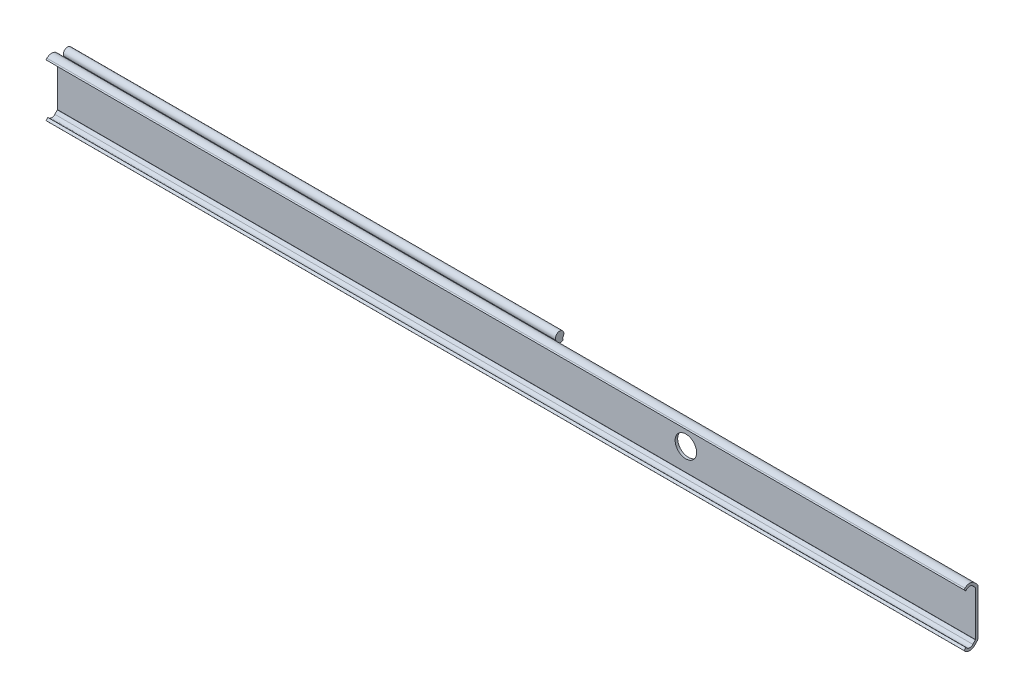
ISO-10303-21;
HEADER;
FILE_DESCRIPTION(('STEP AP214'),'2;1');
FILE_NAME('part.step','',(''),(''),'','','');
FILE_SCHEMA(('AUTOMOTIVE_DESIGN { 1 0 10303 214 1 1 1 1 }'));
ENDSEC;
DATA;
#1=APPLICATION_CONTEXT('core data for automotive mechanical design processes');
#2=APPLICATION_PROTOCOL_DEFINITION('international standard','automotive_design',2000,#1);
#3=PRODUCT_CONTEXT('',#1,'mechanical');
#4=PRODUCT('Part','Part','',(#3));
#5=PRODUCT_RELATED_PRODUCT_CATEGORY('part','',(#4));
#6=PRODUCT_DEFINITION_FORMATION('','',#4);
#7=PRODUCT_DEFINITION_CONTEXT('part definition',#1,'design');
#8=PRODUCT_DEFINITION('design','',#6,#7);
#9=PRODUCT_DEFINITION_SHAPE('','',#8);
#10=(LENGTH_UNIT() NAMED_UNIT(*) SI_UNIT(.MILLI.,.METRE.));
#11=(NAMED_UNIT(*) PLANE_ANGLE_UNIT() SI_UNIT($,.RADIAN.));
#12=(NAMED_UNIT(*) SI_UNIT($,.STERADIAN.) SOLID_ANGLE_UNIT());
#13=UNCERTAINTY_MEASURE_WITH_UNIT(LENGTH_MEASURE(1.E-05),#10,'distance_accuracy_value','');
#14=(GEOMETRIC_REPRESENTATION_CONTEXT(3) GLOBAL_UNCERTAINTY_ASSIGNED_CONTEXT((#13)) GLOBAL_UNIT_ASSIGNED_CONTEXT((#10,
#11,#12)) REPRESENTATION_CONTEXT('',''));
#15=CARTESIAN_POINT('',(0.,0.,0.));
#16=DIRECTION('',(0.,0.,1.));
#17=DIRECTION('',(1.,0.,0.));
#18=AXIS2_PLACEMENT_3D('',#15,#16,#17);
#19=CARTESIAN_POINT('',(0.,-13.5610180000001,0.));
#20=DIRECTION('',(0.,0.,-1.));
#21=DIRECTION('',(1.,0.,0.));
#22=AXIS2_PLACEMENT_3D('',#19,#20,#21);
#23=PLANE('',#22);
#24=CARTESIAN_POINT('',(379.8,0.,0.));
#25=DIRECTION('',(0.,0.,-1.));
#26=DIRECTION('',(0.,1.,0.));
#27=AXIS2_PLACEMENT_3D('',#24,#25,#26);
#28=CIRCLE('',#27,6.5);
#29=CARTESIAN_POINT('',(379.8,6.5,0.));
#30=VERTEX_POINT('',#29);
#31=EDGE_CURVE('E326',#30,#30,#28,.T.);
#32=ORIENTED_EDGE('',*,*,#31,.F.);
#33=EDGE_LOOP('',(#32));
#34=FACE_BOUND('',#33,.T.);
#35=DIRECTION('',(0.,1.,0.));
#36=VECTOR('',#35,1.);
#37=CARTESIAN_POINT('',(0.,-13.5610180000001,0.));
#38=LINE('',#37,#36);
#39=CARTESIAN_POINT('',(0.,-13.5610180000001,0.));
#40=VERTEX_POINT('',#39);
#41=CARTESIAN_POINT('',(0.,-10.7622239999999,0.));
#42=VERTEX_POINT('',#41);
#43=EDGE_CURVE('E443',#40,#42,#38,.T.);
#44=ORIENTED_EDGE('',*,*,#43,.T.);
#45=DIRECTION('',(1.,0.,0.));
#46=VECTOR('',#45,1.);
#47=CARTESIAN_POINT('',(0.,-10.7622239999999,0.));
#48=LINE('',#47,#46);
#49=CARTESIAN_POINT('',(297.4,-10.7622239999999,0.));
#50=VERTEX_POINT('',#49);
#51=EDGE_CURVE('E9',#42,#50,#48,.T.);
#52=ORIENTED_EDGE('',*,*,#51,.T.);
#53=DIRECTION('',(0.,-1.,0.));
#54=VECTOR('',#53,1.);
#55=CARTESIAN_POINT('',(297.4,10.7622239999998,0.));
#56=LINE('',#55,#54);
#57=CARTESIAN_POINT('',(297.4,10.7622239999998,0.));
#58=VERTEX_POINT('',#57);
#59=EDGE_CURVE('E323',#58,#50,#56,.T.);
#60=ORIENTED_EDGE('',*,*,#59,.F.);
#61=DIRECTION('',(1.,0.,0.));
#62=VECTOR('',#61,1.);
#63=CARTESIAN_POINT('',(0.,10.7622239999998,0.));
#64=LINE('',#63,#62);
#65=CARTESIAN_POINT('',(0.,10.7622239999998,0.));
#66=VERTEX_POINT('',#65);
#67=EDGE_CURVE('E23',#66,#58,#64,.T.);
#68=ORIENTED_EDGE('',*,*,#67,.F.);
#69=CARTESIAN_POINT('',(0.,13.561018,0.));
#70=VERTEX_POINT('',#69);
#71=EDGE_CURVE('E442',#66,#70,#38,.T.);
#72=ORIENTED_EDGE('',*,*,#71,.T.);
#73=DIRECTION('',(1.,0.,0.));
#74=VECTOR('',#73,1.);
#75=CARTESIAN_POINT('',(0.,13.561018,0.));
#76=LINE('',#75,#74);
#77=CARTESIAN_POINT('',(554.8,13.561018,0.));
#78=VERTEX_POINT('',#77);
#79=EDGE_CURVE('E456',#70,#78,#76,.T.);
#80=ORIENTED_EDGE('',*,*,#79,.T.);
#81=DIRECTION('',(0.,1.,0.));
#82=VECTOR('',#81,1.);
#83=CARTESIAN_POINT('',(554.8,-13.5610180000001,0.));
#84=LINE('',#83,#82);
#85=CARTESIAN_POINT('',(554.8,-13.5610180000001,0.));
#86=VERTEX_POINT('',#85);
#87=EDGE_CURVE('E383',#86,#78,#84,.T.);
#88=ORIENTED_EDGE('',*,*,#87,.F.);
#89=DIRECTION('',(1.,0.,0.));
#90=VECTOR('',#89,1.);
#91=CARTESIAN_POINT('',(0.,-13.5610180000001,0.));
#92=LINE('',#91,#90);
#93=EDGE_CURVE('E459',#40,#86,#92,.T.);
#94=ORIENTED_EDGE('',*,*,#93,.F.);
#95=EDGE_LOOP('',(#44,#52,#60,#68,#72,#80,#88,#94));
#96=FACE_BOUND('',#95,.T.);
#97=ADVANCED_FACE('F14',(#34,#96),#23,.T.);
#98=CARTESIAN_POINT('',(0.,-10.7622239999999,-1.66));
#99=DIRECTION('',(1.,0.,0.));
#100=DIRECTION('',(0.,0.,1.));
#101=AXIS2_PLACEMENT_3D('',#98,#99,#100);
#102=CYLINDRICAL_SURFACE('',#101,1.66);
#103=DIRECTION('',(1.,0.,0.));
#104=VECTOR('',#103,1.);
#105=CARTESIAN_POINT('',(0.,-12.2669175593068,-2.36106867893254));
#106=LINE('',#105,#104);
#107=CARTESIAN_POINT('',(0.,-12.2669175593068,-2.36106867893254));
#108=VERTEX_POINT('',#107);
#109=CARTESIAN_POINT('',(297.4,-12.2669175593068,-2.36106867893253));
#110=VERTEX_POINT('',#109);
#111=EDGE_CURVE('E237',#108,#110,#106,.T.);
#112=ORIENTED_EDGE('',*,*,#111,.T.);
#113=CARTESIAN_POINT('',(297.4,-10.7622239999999,-1.66));
#114=DIRECTION('',(1.,0.,0.));
#115=DIRECTION('',(0.,0.,-1.));
#116=AXIS2_PLACEMENT_3D('',#113,#114,#115);
#117=CIRCLE('',#116,1.66);
#118=EDGE_CURVE('E297',#50,#110,#117,.T.);
#119=ORIENTED_EDGE('',*,*,#118,.F.);
#120=ORIENTED_EDGE('',*,*,#51,.F.);
#121=CARTESIAN_POINT('',(0.,-10.7622239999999,-1.66));
#122=DIRECTION('',(1.,0.,0.));
#123=DIRECTION('',(0.,0.,-1.));
#124=AXIS2_PLACEMENT_3D('',#121,#122,#123);
#125=CIRCLE('',#124,1.66);
#126=EDGE_CURVE('E253',#42,#108,#125,.T.);
#127=ORIENTED_EDGE('',*,*,#126,.T.);
#128=EDGE_LOOP('',(#112,#119,#120,#127));
#129=FACE_BOUND('',#128,.T.);
#130=ADVANCED_FACE('F258',(#129),#102,.T.);
#131=CARTESIAN_POINT('',(0.,10.7622239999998,-1.66));
#132=DIRECTION('',(1.,0.,0.));
#133=DIRECTION('',(0.,0.,1.));
#134=AXIS2_PLACEMENT_3D('',#131,#132,#133);
#135=CYLINDRICAL_SURFACE('',#134,1.66);
#136=CARTESIAN_POINT('',(297.4,10.7622239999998,-1.66));
#137=DIRECTION('',(1.,0.,0.));
#138=DIRECTION('',(0.,0.,-1.));
#139=AXIS2_PLACEMENT_3D('',#136,#137,#138);
#140=CIRCLE('',#139,1.65999999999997);
#141=CARTESIAN_POINT('',(297.4,12.2669175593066,-2.36106867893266));
#142=VERTEX_POINT('',#141);
#143=EDGE_CURVE('E321',#142,#58,#140,.T.);
#144=ORIENTED_EDGE('',*,*,#143,.F.);
#145=DIRECTION('',(1.,0.,0.));
#146=VECTOR('',#145,1.);
#147=CARTESIAN_POINT('',(0.,12.2669175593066,-2.36106867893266));
#148=LINE('',#147,#146);
#149=CARTESIAN_POINT('',(0.,12.2669175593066,-2.36106867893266));
#150=VERTEX_POINT('',#149);
#151=EDGE_CURVE('E295',#150,#142,#148,.T.);
#152=ORIENTED_EDGE('',*,*,#151,.F.);
#153=CARTESIAN_POINT('',(0.,10.7622239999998,-1.66));
#154=DIRECTION('',(1.,0.,0.));
#155=DIRECTION('',(0.,0.,-1.));
#156=AXIS2_PLACEMENT_3D('',#153,#154,#155);
#157=CIRCLE('',#156,1.65999999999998);
#158=EDGE_CURVE('E245',#150,#66,#157,.T.);
#159=ORIENTED_EDGE('',*,*,#158,.T.);
#160=ORIENTED_EDGE('',*,*,#67,.T.);
#161=EDGE_LOOP('',(#144,#152,#159,#160));
#162=FACE_BOUND('',#161,.T.);
#163=ADVANCED_FACE('F554',(#162),#135,.T.);
#164=CARTESIAN_POINT('',(0.,11.8784795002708,-5.98462837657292));
#165=DIRECTION('',(0.,0.60181512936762,-0.798635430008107));
#166=DIRECTION('',(0.,0.798635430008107,0.60181512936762));
#167=AXIS2_PLACEMENT_3D('',#164,#165,#166);
#168=PLANE('',#167);
#169=DIRECTION('',(1.,0.,0.));
#170=VECTOR('',#169,1.);
#171=CARTESIAN_POINT('',(0.,11.6159967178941,-6.18242339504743));
#172=LINE('',#171,#170);
#173=CARTESIAN_POINT('',(0.,11.6159967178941,-6.18242339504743));
#174=VERTEX_POINT('',#173);
#175=CARTESIAN_POINT('',(297.4,11.6159967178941,-6.18242339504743));
#176=VERTEX_POINT('',#175);
#177=EDGE_CURVE('E298',#174,#176,#172,.T.);
#178=ORIENTED_EDGE('',*,*,#177,.T.);
#179=DIRECTION('',(0.,0.798635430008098,0.601815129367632));
#180=VECTOR('',#179,1.);
#181=CARTESIAN_POINT('',(297.4,11.0618539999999,-6.6));
#182=LINE('',#181,#180);
#183=CARTESIAN_POINT('',(297.4,11.0618539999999,-6.6));
#184=VERTEX_POINT('',#183);
#185=EDGE_CURVE('E318',#184,#176,#182,.T.);
#186=ORIENTED_EDGE('',*,*,#185,.F.);
#187=DIRECTION('',(1.,0.,0.));
#188=VECTOR('',#187,1.);
#189=CARTESIAN_POINT('',(0.,11.0618539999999,-6.6));
#190=LINE('',#189,#188);
#191=CARTESIAN_POINT('',(0.,11.0618539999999,-6.6));
#192=VERTEX_POINT('',#191);
#193=EDGE_CURVE('E335',#192,#184,#190,.T.);
#194=ORIENTED_EDGE('',*,*,#193,.F.);
#195=DIRECTION('',(0.,0.798635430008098,0.601815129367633));
#196=VECTOR('',#195,1.);
#197=CARTESIAN_POINT('',(0.,11.0618539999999,-6.6));
#198=LINE('',#197,#196);
#199=EDGE_CURVE('E286',#192,#174,#198,.T.);
#200=ORIENTED_EDGE('',*,*,#199,.T.);
#201=EDGE_LOOP('',(#178,#186,#194,#200));
#202=FACE_BOUND('',#201,.T.);
#203=ADVANCED_FACE('F547',(#202),#168,.T.);
#204=CARTESIAN_POINT('',(0.,11.0618539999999,-6.6));
#205=DIRECTION('',(0.,0.,-1.));
#206=DIRECTION('',(1.,0.,0.));
#207=AXIS2_PLACEMENT_3D('',#204,#205,#206);
#208=PLANE('',#207);
#209=ORIENTED_EDGE('',*,*,#193,.T.);
#210=DIRECTION('',(0.,1.,0.));
#211=VECTOR('',#210,1.);
#212=CARTESIAN_POINT('',(297.4,10.4239399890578,-6.6));
#213=LINE('',#212,#211);
#214=CARTESIAN_POINT('',(297.4,10.4239399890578,-6.6));
#215=VERTEX_POINT('',#214);
#216=EDGE_CURVE('E316',#215,#184,#213,.T.);
#217=ORIENTED_EDGE('',*,*,#216,.F.);
#218=DIRECTION('',(1.,0.,0.));
#219=VECTOR('',#218,1.);
#220=CARTESIAN_POINT('',(0.,10.4239399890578,-6.6));
#221=LINE('',#220,#219);
#222=CARTESIAN_POINT('',(0.,10.4239399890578,-6.6));
#223=VERTEX_POINT('',#222);
#224=EDGE_CURVE('E495',#223,#215,#221,.T.);
#225=ORIENTED_EDGE('',*,*,#224,.F.);
#226=DIRECTION('',(0.,1.,0.));
#227=VECTOR('',#226,1.);
#228=CARTESIAN_POINT('',(0.,10.4239399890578,-6.6));
#229=LINE('',#228,#227);
#230=EDGE_CURVE('E283',#223,#192,#229,.T.);
#231=ORIENTED_EDGE('',*,*,#230,.T.);
#232=EDGE_LOOP('',(#209,#217,#225,#231));
#233=FACE_BOUND('',#232,.T.);
#234=ADVANCED_FACE('F542',(#233),#208,.T.);
#235=CARTESIAN_POINT('',(0.,13.915,-4.44999999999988));
#236=DIRECTION('',(1.,0.,0.));
#237=DIRECTION('',(0.,0.,1.));
#238=AXIS2_PLACEMENT_3D('',#235,#236,#237);
#239=CYLINDRICAL_SURFACE('',#238,4.1);
#240=ORIENTED_EDGE('',*,*,#224,.T.);
#241=CARTESIAN_POINT('',(297.4,13.915,-4.44999999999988));
#242=DIRECTION('',(1.,0.,0.));
#243=DIRECTION('',(0.,0.,-1.));
#244=AXIS2_PLACEMENT_3D('',#241,#242,#243);
#245=CIRCLE('',#244,4.1);
#246=CARTESIAN_POINT('',(297.4,10.844402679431,-1.73312089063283));
#247=VERTEX_POINT('',#246);
#248=EDGE_CURVE('E314',#247,#215,#245,.T.);
#249=ORIENTED_EDGE('',*,*,#248,.F.);
#250=DIRECTION('',(1.,0.,0.));
#251=VECTOR('',#250,1.);
#252=CARTESIAN_POINT('',(0.,10.8444026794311,-1.73312089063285));
#253=LINE('',#252,#251);
#254=CARTESIAN_POINT('',(0.,10.844402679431,-1.73312089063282));
#255=VERTEX_POINT('',#254);
#256=EDGE_CURVE('E498',#255,#247,#253,.T.);
#257=ORIENTED_EDGE('',*,*,#256,.F.);
#258=CARTESIAN_POINT('',(0.,13.915,-4.44999999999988));
#259=DIRECTION('',(1.,0.,0.));
#260=DIRECTION('',(0.,0.,-1.));
#261=AXIS2_PLACEMENT_3D('',#258,#259,#260);
#262=CIRCLE('',#261,4.1);
#263=EDGE_CURVE('E280',#255,#223,#262,.T.);
#264=ORIENTED_EDGE('',*,*,#263,.T.);
#265=EDGE_LOOP('',(#240,#249,#257,#264));
#266=FACE_BOUND('',#265,.T.);
#267=ADVANCED_FACE('F540',(#266),#239,.T.);
#268=CARTESIAN_POINT('',(0.,10.7622239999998,-1.66));
#269=DIRECTION('',(1.,0.,0.));
#270=DIRECTION('',(0.,0.,1.));
#271=AXIS2_PLACEMENT_3D('',#268,#269,#270);
#272=CYLINDRICAL_SURFACE('',#271,0.110000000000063);
#273=ORIENTED_EDGE('',*,*,#256,.T.);
#274=CARTESIAN_POINT('',(297.4,10.7622239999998,-1.66));
#275=DIRECTION('',(-1.,0.,0.));
#276=DIRECTION('',(0.,0.,-1.));
#277=AXIS2_PLACEMENT_3D('',#274,#275,#276);
#278=CIRCLE('',#277,0.110000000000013);
#279=CARTESIAN_POINT('',(297.4,10.7622239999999,-1.55));
#280=VERTEX_POINT('',#279);
#281=EDGE_CURVE('E312',#280,#247,#278,.T.);
#282=ORIENTED_EDGE('',*,*,#281,.F.);
#283=DIRECTION('',(1.,0.,0.));
#284=VECTOR('',#283,1.);
#285=CARTESIAN_POINT('',(0.,10.7622239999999,-1.55));
#286=LINE('',#285,#284);
#287=CARTESIAN_POINT('',(0.,10.7622239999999,-1.55));
#288=VERTEX_POINT('',#287);
#289=EDGE_CURVE('E501',#288,#280,#286,.T.);
#290=ORIENTED_EDGE('',*,*,#289,.F.);
#291=CARTESIAN_POINT('',(0.,10.7622239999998,-1.66));
#292=DIRECTION('',(-1.,0.,0.));
#293=DIRECTION('',(0.,0.,-1.));
#294=AXIS2_PLACEMENT_3D('',#291,#292,#293);
#295=CIRCLE('',#294,0.110000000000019);
#296=EDGE_CURVE('E277',#288,#255,#295,.T.);
#297=ORIENTED_EDGE('',*,*,#296,.T.);
#298=EDGE_LOOP('',(#273,#282,#290,#297));
#299=FACE_BOUND('',#298,.T.);
#300=ADVANCED_FACE('F535',(#299),#272,.F.);
#301=CARTESIAN_POINT('',(0.,-10.762224,-1.55));
#302=DIRECTION('',(0.,0.,-1.));
#303=DIRECTION('',(1.,0.,0.));
#304=AXIS2_PLACEMENT_3D('',#301,#302,#303);
#305=PLANE('',#304);
#306=ORIENTED_EDGE('',*,*,#289,.T.);
#307=DIRECTION('',(0.,1.,0.));
#308=VECTOR('',#307,1.);
#309=CARTESIAN_POINT('',(297.4,-10.762224,-1.55));
#310=LINE('',#309,#308);
#311=CARTESIAN_POINT('',(297.4,-10.762224,-1.55));
#312=VERTEX_POINT('',#311);
#313=EDGE_CURVE('E310',#312,#280,#310,.T.);
#314=ORIENTED_EDGE('',*,*,#313,.F.);
#315=DIRECTION('',(1.,0.,0.));
#316=VECTOR('',#315,1.);
#317=CARTESIAN_POINT('',(0.,-10.762224,-1.55));
#318=LINE('',#317,#316);
#319=CARTESIAN_POINT('',(0.,-10.762224,-1.55));
#320=VERTEX_POINT('',#319);
#321=EDGE_CURVE('E504',#320,#312,#318,.T.);
#322=ORIENTED_EDGE('',*,*,#321,.F.);
#323=DIRECTION('',(0.,1.,0.));
#324=VECTOR('',#323,1.);
#325=CARTESIAN_POINT('',(0.,-10.762224,-1.55));
#326=LINE('',#325,#324);
#327=EDGE_CURVE('E274',#320,#288,#326,.T.);
#328=ORIENTED_EDGE('',*,*,#327,.T.);
#329=EDGE_LOOP('',(#306,#314,#322,#328));
#330=FACE_BOUND('',#329,.T.);
#331=ADVANCED_FACE('F530',(#330),#305,.T.);
#332=CARTESIAN_POINT('',(0.,-10.7622239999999,-1.66));
#333=DIRECTION('',(1.,0.,0.));
#334=DIRECTION('',(0.,0.,1.));
#335=AXIS2_PLACEMENT_3D('',#332,#333,#334);
#336=CYLINDRICAL_SURFACE('',#335,0.110000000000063);
#337=ORIENTED_EDGE('',*,*,#321,.T.);
#338=CARTESIAN_POINT('',(297.4,-10.7622239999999,-1.66));
#339=DIRECTION('',(-1.,0.,0.));
#340=DIRECTION('',(0.,0.,-1.));
#341=AXIS2_PLACEMENT_3D('',#338,#339,#340);
#342=CIRCLE('',#341,0.110000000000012);
#343=CARTESIAN_POINT('',(297.4,-10.8444026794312,-1.73312089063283));
#344=VERTEX_POINT('',#343);
#345=EDGE_CURVE('E308',#344,#312,#342,.T.);
#346=ORIENTED_EDGE('',*,*,#345,.F.);
#347=DIRECTION('',(1.,0.,0.));
#348=VECTOR('',#347,1.);
#349=CARTESIAN_POINT('',(0.,-10.8444026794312,-1.73312089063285));
#350=LINE('',#349,#348);
#351=CARTESIAN_POINT('',(0.,-10.8444026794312,-1.73312089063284));
#352=VERTEX_POINT('',#351);
#353=EDGE_CURVE('E507',#352,#344,#350,.T.);
#354=ORIENTED_EDGE('',*,*,#353,.F.);
#355=CARTESIAN_POINT('',(0.,-10.7622239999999,-1.66));
#356=DIRECTION('',(-1.,0.,0.));
#357=DIRECTION('',(0.,0.,-1.));
#358=AXIS2_PLACEMENT_3D('',#355,#356,#357);
#359=CIRCLE('',#358,0.110000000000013);
#360=EDGE_CURVE('E271',#352,#320,#359,.T.);
#361=ORIENTED_EDGE('',*,*,#360,.T.);
#362=EDGE_LOOP('',(#337,#346,#354,#361));
#363=FACE_BOUND('',#362,.T.);
#364=ADVANCED_FACE('F528',(#363),#336,.F.);
#365=CARTESIAN_POINT('',(0.,-13.915,-4.44999999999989));
#366=DIRECTION('',(1.,0.,0.));
#367=DIRECTION('',(0.,0.,1.));
#368=AXIS2_PLACEMENT_3D('',#365,#366,#367);
#369=CYLINDRICAL_SURFACE('',#368,4.1);
#370=ORIENTED_EDGE('',*,*,#353,.T.);
#371=CARTESIAN_POINT('',(297.4,-13.915,-4.44999999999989));
#372=DIRECTION('',(1.,0.,0.));
#373=DIRECTION('',(0.,0.,-1.));
#374=AXIS2_PLACEMENT_3D('',#371,#372,#373);
#375=CIRCLE('',#374,4.09999999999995);
#376=CARTESIAN_POINT('',(297.4,-10.4239399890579,-6.6));
#377=VERTEX_POINT('',#376);
#378=EDGE_CURVE('E306',#377,#344,#375,.T.);
#379=ORIENTED_EDGE('',*,*,#378,.F.);
#380=DIRECTION('',(1.,0.,0.));
#381=VECTOR('',#380,1.);
#382=CARTESIAN_POINT('',(0.,-10.4239399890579,-6.6));
#383=LINE('',#382,#381);
#384=CARTESIAN_POINT('',(0.,-10.4239399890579,-6.6));
#385=VERTEX_POINT('',#384);
#386=EDGE_CURVE('E509',#385,#377,#383,.T.);
#387=ORIENTED_EDGE('',*,*,#386,.F.);
#388=CARTESIAN_POINT('',(0.,-13.915,-4.44999999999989));
#389=DIRECTION('',(1.,0.,0.));
#390=DIRECTION('',(0.,0.,-1.));
#391=AXIS2_PLACEMENT_3D('',#388,#389,#390);
#392=CIRCLE('',#391,4.09999999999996);
#393=EDGE_CURVE('E268',#385,#352,#392,.T.);
#394=ORIENTED_EDGE('',*,*,#393,.T.);
#395=EDGE_LOOP('',(#370,#379,#387,#394));
#396=FACE_BOUND('',#395,.T.);
#397=ADVANCED_FACE('F521',(#396),#369,.T.);
#398=CARTESIAN_POINT('',(0.,-11.061854,-6.6));
#399=DIRECTION('',(0.,0.,-1.));
#400=DIRECTION('',(1.,0.,0.));
#401=AXIS2_PLACEMENT_3D('',#398,#399,#400);
#402=PLANE('',#401);
#403=ORIENTED_EDGE('',*,*,#386,.T.);
#404=DIRECTION('',(0.,1.,0.));
#405=VECTOR('',#404,1.);
#406=CARTESIAN_POINT('',(297.4,-11.061854,-6.6));
#407=LINE('',#406,#405);
#408=CARTESIAN_POINT('',(297.4,-11.061854,-6.6));
#409=VERTEX_POINT('',#408);
#410=EDGE_CURVE('E304',#409,#377,#407,.T.);
#411=ORIENTED_EDGE('',*,*,#410,.F.);
#412=DIRECTION('',(1.,0.,0.));
#413=VECTOR('',#412,1.);
#414=CARTESIAN_POINT('',(0.,-11.061854,-6.6));
#415=LINE('',#414,#413);
#416=CARTESIAN_POINT('',(0.,-11.061854,-6.6));
#417=VERTEX_POINT('',#416);
#418=EDGE_CURVE('E18',#417,#409,#415,.T.);
#419=ORIENTED_EDGE('',*,*,#418,.F.);
#420=DIRECTION('',(0.,1.,0.));
#421=VECTOR('',#420,1.);
#422=CARTESIAN_POINT('',(0.,-11.061854,-6.6));
#423=LINE('',#422,#421);
#424=EDGE_CURVE('E265',#417,#385,#423,.T.);
#425=ORIENTED_EDGE('',*,*,#424,.T.);
#426=EDGE_LOOP('',(#403,#411,#419,#425));
#427=FACE_BOUND('',#426,.T.);
#428=ADVANCED_FACE('F516',(#427),#402,.T.);
#429=CARTESIAN_POINT('',(0.,-11.8784795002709,-5.98462837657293));
#430=DIRECTION('',(0.,-0.60181512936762,-0.798635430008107));
#431=DIRECTION('',(0.,0.798635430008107,-0.60181512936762));
#432=AXIS2_PLACEMENT_3D('',#429,#430,#431);
#433=PLANE('',#432);
#434=DIRECTION('',(0.,0.798635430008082,-0.601815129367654));
#435=VECTOR('',#434,1.);
#436=CARTESIAN_POINT('',(297.4,-11.878479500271,-5.98462837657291));
#437=LINE('',#436,#435);
#438=CARTESIAN_POINT('',(297.4,-11.6159967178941,-6.18242339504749));
#439=VERTEX_POINT('',#438);
#440=EDGE_CURVE('E302',#439,#409,#437,.T.);
#441=ORIENTED_EDGE('',*,*,#440,.F.);
#442=DIRECTION('',(1.,0.,0.));
#443=VECTOR('',#442,1.);
#444=CARTESIAN_POINT('',(0.,-11.6159967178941,-6.18242339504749));
#445=LINE('',#444,#443);
#446=CARTESIAN_POINT('',(0.,-11.6159967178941,-6.18242339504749));
#447=VERTEX_POINT('',#446);
#448=EDGE_CURVE('E244',#447,#439,#445,.T.);
#449=ORIENTED_EDGE('',*,*,#448,.F.);
#450=DIRECTION('',(0.,0.798635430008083,-0.601815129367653));
#451=VECTOR('',#450,1.);
#452=CARTESIAN_POINT('',(0.,-11.6159967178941,-6.18242339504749));
#453=LINE('',#452,#451);
#454=EDGE_CURVE('E256',#447,#417,#453,.T.);
#455=ORIENTED_EDGE('',*,*,#454,.T.);
#456=ORIENTED_EDGE('',*,*,#418,.T.);
#457=EDGE_LOOP('',(#441,#449,#455,#456));
#458=FACE_BOUND('',#457,.T.);
#459=ADVANCED_FACE('F16',(#458),#433,.T.);
#460=CARTESIAN_POINT('',(0.,14.8073560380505,0.501292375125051));
#461=DIRECTION('',(0.,0.692409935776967,-0.721504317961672));
#462=DIRECTION('',(0.,0.721504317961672,0.692409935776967));
#463=AXIS2_PLACEMENT_3D('',#460,#461,#462);
#464=PLANE('',#463);
#465=DIRECTION('',(0.,0.721504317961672,0.692409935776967));
#466=VECTOR('',#465,1.);
#467=CARTESIAN_POINT('',(554.8,14.8073560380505,0.501292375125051));
#468=LINE('',#467,#466);
#469=CARTESIAN_POINT('',(554.8,14.8073560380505,0.501292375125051));
#470=VERTEX_POINT('',#469);
#471=CARTESIAN_POINT('',(554.8,16.4741282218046,2.10085261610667));
#472=VERTEX_POINT('',#471);
#473=EDGE_CURVE('E388',#470,#472,#468,.T.);
#474=ORIENTED_EDGE('',*,*,#473,.F.);
#475=DIRECTION('',(1.,0.,0.));
#476=VECTOR('',#475,1.);
#477=CARTESIAN_POINT('',(0.,14.8073560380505,0.501292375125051));
#478=LINE('',#477,#476);
#479=CARTESIAN_POINT('',(0.,14.8073560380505,0.501292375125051));
#480=VERTEX_POINT('',#479);
#481=EDGE_CURVE('E454',#480,#470,#478,.T.);
#482=ORIENTED_EDGE('',*,*,#481,.F.);
#483=DIRECTION('',(0.,0.721504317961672,0.692409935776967));
#484=VECTOR('',#483,1.);
#485=CARTESIAN_POINT('',(0.,14.8073560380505,0.501292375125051));
#486=LINE('',#485,#484);
#487=CARTESIAN_POINT('',(0.,16.4741282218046,2.10085261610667));
#488=VERTEX_POINT('',#487);
#489=EDGE_CURVE('E448',#480,#488,#486,.T.);
#490=ORIENTED_EDGE('',*,*,#489,.T.);
#491=DIRECTION('',(1.,0.,0.));
#492=VECTOR('',#491,1.);
#493=CARTESIAN_POINT('',(0.,16.4741282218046,2.10085261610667));
#494=LINE('',#493,#492);
#495=EDGE_CURVE('E452',#488,#472,#494,.T.);
#496=ORIENTED_EDGE('',*,*,#495,.T.);
#497=EDGE_LOOP('',(#474,#482,#490,#496));
#498=FACE_BOUND('',#497,.T.);
#499=ADVANCED_FACE('F627',(#498),#464,.T.);
#500=CARTESIAN_POINT('',(0.,13.5610179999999,1.8));
#501=DIRECTION('',(1.,0.,0.));
#502=DIRECTION('',(0.,0.,1.));
#503=AXIS2_PLACEMENT_3D('',#500,#501,#502);
#504=CYLINDRICAL_SURFACE('',#503,1.8);
#505=CARTESIAN_POINT('',(554.8,13.5610179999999,1.8));
#506=DIRECTION('',(1.,0.,0.));
#507=DIRECTION('',(0.,0.,-1.));
#508=AXIS2_PLACEMENT_3D('',#505,#506,#507);
#509=CIRCLE('',#508,1.8);
#510=EDGE_CURVE('E385',#78,#470,#509,.T.);
#511=ORIENTED_EDGE('',*,*,#510,.F.);
#512=ORIENTED_EDGE('',*,*,#79,.F.);
#513=CARTESIAN_POINT('',(0.,13.5610179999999,1.8));
#514=DIRECTION('',(1.,0.,0.));
#515=DIRECTION('',(0.,0.,-1.));
#516=AXIS2_PLACEMENT_3D('',#513,#514,#515);
#517=CIRCLE('',#516,1.8);
#518=EDGE_CURVE('E445',#70,#480,#517,.T.);
#519=ORIENTED_EDGE('',*,*,#518,.T.);
#520=ORIENTED_EDGE('',*,*,#481,.T.);
#521=EDGE_LOOP('',(#511,#512,#519,#520));
#522=FACE_BOUND('',#521,.T.);
#523=ADVANCED_FACE('F631',(#522),#504,.T.);
#524=CARTESIAN_POINT('',(0.,-13.561018,1.8));
#525=DIRECTION('',(1.,0.,0.));
#526=DIRECTION('',(0.,0.,1.));
#527=AXIS2_PLACEMENT_3D('',#524,#525,#526);
#528=CYLINDRICAL_SURFACE('',#527,1.8);
#529=CARTESIAN_POINT('',(554.8,-13.561018,1.8));
#530=DIRECTION('',(1.,0.,0.));
#531=DIRECTION('',(0.,0.,1.));
#532=AXIS2_PLACEMENT_3D('',#529,#530,#531);
#533=CIRCLE('',#532,1.8);
#534=CARTESIAN_POINT('',(554.8,-14.8073560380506,0.50129237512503));
#535=VERTEX_POINT('',#534);
#536=EDGE_CURVE('E380',#535,#86,#533,.T.);
#537=ORIENTED_EDGE('',*,*,#536,.F.);
#538=DIRECTION('',(1.,0.,0.));
#539=VECTOR('',#538,1.);
#540=CARTESIAN_POINT('',(0.,-14.8073560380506,0.50129237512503));
#541=LINE('',#540,#539);
#542=CARTESIAN_POINT('',(0.,-14.8073560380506,0.50129237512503));
#543=VERTEX_POINT('',#542);
#544=EDGE_CURVE('E461',#543,#535,#541,.T.);
#545=ORIENTED_EDGE('',*,*,#544,.F.);
#546=CARTESIAN_POINT('',(0.,-13.561018,1.8));
#547=DIRECTION('',(1.,0.,0.));
#548=DIRECTION('',(0.,0.,1.));
#549=AXIS2_PLACEMENT_3D('',#546,#547,#548);
#550=CIRCLE('',#549,1.8);
#551=EDGE_CURVE('E439',#543,#40,#550,.T.);
#552=ORIENTED_EDGE('',*,*,#551,.T.);
#553=ORIENTED_EDGE('',*,*,#93,.T.);
#554=EDGE_LOOP('',(#537,#545,#552,#553));
#555=FACE_BOUND('',#554,.T.);
#556=ADVANCED_FACE('F560',(#555),#528,.T.);
#557=CARTESIAN_POINT('',(0.,-14.8073560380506,0.50129237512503));
#558=DIRECTION('',(0.,-0.692409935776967,-0.721504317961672));
#559=DIRECTION('',(0.,0.721504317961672,-0.692409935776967));
#560=AXIS2_PLACEMENT_3D('',#557,#558,#559);
#561=PLANE('',#560);
#562=DIRECTION('',(0.,0.721504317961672,-0.692409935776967));
#563=VECTOR('',#562,1.);
#564=CARTESIAN_POINT('',(554.8,-14.8073560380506,0.50129237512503));
#565=LINE('',#564,#563);
#566=CARTESIAN_POINT('',(554.8,-16.4741282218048,2.10085261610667));
#567=VERTEX_POINT('',#566);
#568=EDGE_CURVE('E377',#567,#535,#565,.T.);
#569=ORIENTED_EDGE('',*,*,#568,.F.);
#570=DIRECTION('',(1.,0.,0.));
#571=VECTOR('',#570,1.);
#572=CARTESIAN_POINT('',(0.,-16.4741282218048,2.10085261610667));
#573=LINE('',#572,#571);
#574=CARTESIAN_POINT('',(0.,-16.4741282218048,2.10085261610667));
#575=VERTEX_POINT('',#574);
#576=EDGE_CURVE('E463',#575,#567,#573,.T.);
#577=ORIENTED_EDGE('',*,*,#576,.F.);
#578=DIRECTION('',(0.,0.721504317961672,-0.692409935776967));
#579=VECTOR('',#578,1.);
#580=CARTESIAN_POINT('',(0.,-14.8073560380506,0.50129237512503));
#581=LINE('',#580,#579);
#582=EDGE_CURVE('E436',#575,#543,#581,.T.);
#583=ORIENTED_EDGE('',*,*,#582,.T.);
#584=ORIENTED_EDGE('',*,*,#544,.T.);
#585=EDGE_LOOP('',(#569,#577,#583,#584));
#586=FACE_BOUND('',#585,.T.);
#587=ADVANCED_FACE('F563',(#586),#561,.T.);
#588=CARTESIAN_POINT('',(0.,-13.5750000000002,5.));
#589=DIRECTION('',(1.,0.,0.));
#590=DIRECTION('',(0.,0.,1.));
#591=AXIS2_PLACEMENT_3D('',#588,#589,#590);
#592=CYLINDRICAL_SURFACE('',#591,4.1);
#593=CARTESIAN_POINT('',(554.8,-13.5750000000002,5.));
#594=DIRECTION('',(1.,0.,0.));
#595=DIRECTION('',(0.,0.,1.));
#596=AXIS2_PLACEMENT_3D('',#593,#594,#595);
#597=CIRCLE('',#596,4.1);
#598=CARTESIAN_POINT('',(554.8,-16.4741282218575,7.89914738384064));
#599=VERTEX_POINT('',#598);
#600=EDGE_CURVE('E374',#599,#567,#597,.T.);
#601=ORIENTED_EDGE('',*,*,#600,.F.);
#602=DIRECTION('',(1.,0.,0.));
#603=VECTOR('',#602,1.);
#604=CARTESIAN_POINT('',(0.,-16.4741282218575,7.89914738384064));
#605=LINE('',#604,#603);
#606=CARTESIAN_POINT('',(0.,-16.4741282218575,7.89914738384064));
#607=VERTEX_POINT('',#606);
#608=EDGE_CURVE('E465',#607,#599,#605,.T.);
#609=ORIENTED_EDGE('',*,*,#608,.F.);
#610=CARTESIAN_POINT('',(0.,-13.5750000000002,5.));
#611=DIRECTION('',(1.,0.,0.));
#612=DIRECTION('',(0.,0.,1.));
#613=AXIS2_PLACEMENT_3D('',#610,#611,#612);
#614=CIRCLE('',#613,4.1);
#615=EDGE_CURVE('E433',#607,#575,#614,.T.);
#616=ORIENTED_EDGE('',*,*,#615,.T.);
#617=ORIENTED_EDGE('',*,*,#576,.T.);
#618=EDGE_LOOP('',(#601,#609,#616,#617));
#619=FACE_BOUND('',#618,.T.);
#620=ADVANCED_FACE('F568',(#619),#592,.T.);
#621=CARTESIAN_POINT('',(0.,-15.8897090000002,8.46));
#622=DIRECTION('',(0.,-0.692409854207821,0.721504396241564));
#623=DIRECTION('',(0.,-0.721504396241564,-0.692409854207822));
#624=AXIS2_PLACEMENT_3D('',#621,#622,#623);
#625=PLANE('',#624);
#626=DIRECTION('',(0.,-0.721504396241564,-0.692409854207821));
#627=VECTOR('',#626,1.);
#628=CARTESIAN_POINT('',(554.8,-15.8897090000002,8.46));
#629=LINE('',#628,#627);
#630=CARTESIAN_POINT('',(554.8,-15.8897090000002,8.46));
#631=VERTEX_POINT('',#630);
#632=EDGE_CURVE('E371',#631,#599,#629,.T.);
#633=ORIENTED_EDGE('',*,*,#632,.F.);
#634=DIRECTION('',(1.,0.,0.));
#635=VECTOR('',#634,1.);
#636=CARTESIAN_POINT('',(0.,-15.8897090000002,8.46));
#637=LINE('',#636,#635);
#638=CARTESIAN_POINT('',(0.,-15.8897090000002,8.46));
#639=VERTEX_POINT('',#638);
#640=EDGE_CURVE('E467',#639,#631,#637,.T.);
#641=ORIENTED_EDGE('',*,*,#640,.F.);
#642=DIRECTION('',(0.,-0.721504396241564,-0.692409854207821));
#643=VECTOR('',#642,1.);
#644=CARTESIAN_POINT('',(0.,-15.8897090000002,8.46));
#645=LINE('',#644,#643);
#646=EDGE_CURVE('E430',#639,#607,#645,.T.);
#647=ORIENTED_EDGE('',*,*,#646,.T.);
#648=ORIENTED_EDGE('',*,*,#608,.T.);
#649=EDGE_LOOP('',(#633,#641,#647,#648));
#650=FACE_BOUND('',#649,.T.);
#651=ADVANCED_FACE('F571',(#650),#625,.T.);
#652=CARTESIAN_POINT('',(0.,-14.7934620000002,7.363752));
#653=DIRECTION('',(0.,0.707107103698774,0.707106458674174));
#654=DIRECTION('',(0.,-0.707106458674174,0.707107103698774));
#655=AXIS2_PLACEMENT_3D('',#652,#653,#654);
#656=PLANE('',#655);
#657=DIRECTION('',(0.,-0.707106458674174,0.707107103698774));
#658=VECTOR('',#657,1.);
#659=CARTESIAN_POINT('',(554.8,-14.7934620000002,7.363752));
#660=LINE('',#659,#658);
#661=CARTESIAN_POINT('',(554.8,-14.7934620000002,7.363752));
#662=VERTEX_POINT('',#661);
#663=EDGE_CURVE('E368',#662,#631,#660,.T.);
#664=ORIENTED_EDGE('',*,*,#663,.F.);
#665=DIRECTION('',(1.,0.,0.));
#666=VECTOR('',#665,1.);
#667=CARTESIAN_POINT('',(0.,-14.7934620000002,7.363752));
#668=LINE('',#667,#666);
#669=CARTESIAN_POINT('',(0.,-14.7934620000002,7.363752));
#670=VERTEX_POINT('',#669);
#671=EDGE_CURVE('E469',#670,#662,#668,.T.);
#672=ORIENTED_EDGE('',*,*,#671,.F.);
#673=DIRECTION('',(0.,-0.707106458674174,0.707107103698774));
#674=VECTOR('',#673,1.);
#675=CARTESIAN_POINT('',(0.,-14.7934620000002,7.363752));
#676=LINE('',#675,#674);
#677=EDGE_CURVE('E427',#670,#639,#676,.T.);
#678=ORIENTED_EDGE('',*,*,#677,.T.);
#679=ORIENTED_EDGE('',*,*,#640,.T.);
#680=EDGE_LOOP('',(#664,#672,#678,#679));
#681=FACE_BOUND('',#680,.T.);
#682=ADVANCED_FACE('F576',(#681),#656,.T.);
#683=CARTESIAN_POINT('',(0.,-15.3880487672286,6.79314086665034));
#684=DIRECTION('',(0.,0.692410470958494,-0.721503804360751));
#685=DIRECTION('',(0.,0.721503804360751,0.692410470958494));
#686=AXIS2_PLACEMENT_3D('',#683,#684,#685);
#687=PLANE('',#686);
#688=DIRECTION('',(0.,0.721503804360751,0.692410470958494));
#689=VECTOR('',#688,1.);
#690=CARTESIAN_POINT('',(554.8,-15.3880487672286,6.79314086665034));
#691=LINE('',#690,#689);
#692=CARTESIAN_POINT('',(554.8,-15.3880487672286,6.79314086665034));
#693=VERTEX_POINT('',#692);
#694=EDGE_CURVE('E365',#693,#662,#691,.T.);
#695=ORIENTED_EDGE('',*,*,#694,.F.);
#696=DIRECTION('',(1.,0.,0.));
#697=VECTOR('',#696,1.);
#698=CARTESIAN_POINT('',(0.,-15.3880487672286,6.79314086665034));
#699=LINE('',#698,#697);
#700=CARTESIAN_POINT('',(0.,-15.3880487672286,6.79314086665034));
#701=VERTEX_POINT('',#700);
#702=EDGE_CURVE('E471',#701,#693,#699,.T.);
#703=ORIENTED_EDGE('',*,*,#702,.F.);
#704=DIRECTION('',(0.,0.721503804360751,0.692410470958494));
#705=VECTOR('',#704,1.);
#706=CARTESIAN_POINT('',(0.,-15.3880487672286,6.79314086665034));
#707=LINE('',#706,#705);
#708=EDGE_CURVE('E424',#701,#670,#707,.T.);
#709=ORIENTED_EDGE('',*,*,#708,.T.);
#710=ORIENTED_EDGE('',*,*,#671,.T.);
#711=EDGE_LOOP('',(#695,#703,#709,#710));
#712=FACE_BOUND('',#711,.T.);
#713=ADVANCED_FACE('F579',(#712),#687,.T.);
#714=CARTESIAN_POINT('',(0.,-13.5750000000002,5.));
#715=DIRECTION('',(1.,0.,0.));
#716=DIRECTION('',(0.,0.,1.));
#717=AXIS2_PLACEMENT_3D('',#714,#715,#716);
#718=CYLINDRICAL_SURFACE('',#717,2.55);
#719=CARTESIAN_POINT('',(554.8,-13.5750000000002,5.));
#720=DIRECTION('',(-1.,0.,0.));
#721=DIRECTION('',(0.,0.,-1.));
#722=AXIS2_PLACEMENT_3D('',#719,#720,#721);
#723=CIRCLE('',#722,2.55);
#724=CARTESIAN_POINT('',(554.8,-15.292068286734,3.11474762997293));
#725=VERTEX_POINT('',#724);
#726=EDGE_CURVE('E362',#725,#693,#723,.T.);
#727=ORIENTED_EDGE('',*,*,#726,.F.);
#728=DIRECTION('',(1.,0.,0.));
#729=VECTOR('',#728,1.);
#730=CARTESIAN_POINT('',(0.,-15.292068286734,3.11474762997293));
#731=LINE('',#730,#729);
#732=CARTESIAN_POINT('',(0.,-15.292068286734,3.11474762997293));
#733=VERTEX_POINT('',#732);
#734=EDGE_CURVE('E473',#733,#725,#731,.T.);
#735=ORIENTED_EDGE('',*,*,#734,.F.);
#736=CARTESIAN_POINT('',(0.,-13.5750000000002,5.));
#737=DIRECTION('',(-1.,0.,0.));
#738=DIRECTION('',(0.,0.,-1.));
#739=AXIS2_PLACEMENT_3D('',#736,#737,#738);
#740=CIRCLE('',#739,2.55);
#741=EDGE_CURVE('E421',#733,#701,#740,.T.);
#742=ORIENTED_EDGE('',*,*,#741,.T.);
#743=ORIENTED_EDGE('',*,*,#702,.T.);
#744=EDGE_LOOP('',(#727,#735,#742,#743));
#745=FACE_BOUND('',#744,.T.);
#746=ADVANCED_FACE('F584',(#745),#718,.F.);
#747=CARTESIAN_POINT('',(0.,-13.734120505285,1.61962394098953));
#748=DIRECTION('',(0.,0.692409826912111,0.721504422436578));
#749=DIRECTION('',(0.,-0.721504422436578,0.692409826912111));
#750=AXIS2_PLACEMENT_3D('',#747,#748,#749);
#751=PLANE('',#750);
#752=DIRECTION('',(0.,-0.721504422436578,0.692409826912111));
#753=VECTOR('',#752,1.);
#754=CARTESIAN_POINT('',(554.8,-13.734120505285,1.61962394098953));
#755=LINE('',#754,#753);
#756=CARTESIAN_POINT('',(554.8,-13.734120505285,1.61962394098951));
#757=VERTEX_POINT('',#756);
#758=EDGE_CURVE('E359',#757,#725,#755,.T.);
#759=ORIENTED_EDGE('',*,*,#758,.F.);
#760=DIRECTION('',(1.,0.,0.));
#761=VECTOR('',#760,1.);
#762=CARTESIAN_POINT('',(0.,-13.734120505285,1.61962394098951));
#763=LINE('',#762,#761);
#764=CARTESIAN_POINT('',(0.,-13.734120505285,1.61962394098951));
#765=VERTEX_POINT('',#764);
#766=EDGE_CURVE('E475',#765,#757,#763,.T.);
#767=ORIENTED_EDGE('',*,*,#766,.F.);
#768=DIRECTION('',(0.,-0.721504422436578,0.692409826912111));
#769=VECTOR('',#768,1.);
#770=CARTESIAN_POINT('',(0.,-13.734120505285,1.61962394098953));
#771=LINE('',#770,#769);
#772=EDGE_CURVE('E418',#765,#733,#771,.T.);
#773=ORIENTED_EDGE('',*,*,#772,.T.);
#774=ORIENTED_EDGE('',*,*,#734,.T.);
#775=EDGE_LOOP('',(#759,#767,#773,#774));
#776=FACE_BOUND('',#775,.T.);
#777=ADVANCED_FACE('F587',(#776),#751,.T.);
#778=CARTESIAN_POINT('',(0.,-13.561018,1.8));
#779=DIRECTION('',(1.,0.,0.));
#780=DIRECTION('',(0.,0.,1.));
#781=AXIS2_PLACEMENT_3D('',#778,#779,#780);
#782=CYLINDRICAL_SURFACE('',#781,0.250000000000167);
#783=CARTESIAN_POINT('',(554.8,-13.561018,1.8));
#784=DIRECTION('',(-1.,0.,0.));
#785=DIRECTION('',(0.,0.,-1.));
#786=AXIS2_PLACEMENT_3D('',#783,#784,#785);
#787=CIRCLE('',#786,0.250000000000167);
#788=CARTESIAN_POINT('',(554.8,-13.5610180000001,1.54999999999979));
#789=VERTEX_POINT('',#788);
#790=EDGE_CURVE('E356',#789,#757,#787,.T.);
#791=ORIENTED_EDGE('',*,*,#790,.F.);
#792=DIRECTION('',(1.,0.,0.));
#793=VECTOR('',#792,1.);
#794=CARTESIAN_POINT('',(0.,-13.5610180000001,1.54999999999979));
#795=LINE('',#794,#793);
#796=CARTESIAN_POINT('',(0.,-13.5610180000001,1.54999999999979));
#797=VERTEX_POINT('',#796);
#798=EDGE_CURVE('E477',#797,#789,#795,.T.);
#799=ORIENTED_EDGE('',*,*,#798,.F.);
#800=CARTESIAN_POINT('',(0.,-13.561018,1.8));
#801=DIRECTION('',(-1.,0.,0.));
#802=DIRECTION('',(0.,0.,-1.));
#803=AXIS2_PLACEMENT_3D('',#800,#801,#802);
#804=CIRCLE('',#803,0.250000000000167);
#805=EDGE_CURVE('E415',#797,#765,#804,.T.);
#806=ORIENTED_EDGE('',*,*,#805,.T.);
#807=ORIENTED_EDGE('',*,*,#766,.T.);
#808=EDGE_LOOP('',(#791,#799,#806,#807));
#809=FACE_BOUND('',#808,.T.);
#810=ADVANCED_FACE('F592',(#809),#782,.F.);
#811=CARTESIAN_POINT('',(0.,13.561018,1.54999999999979));
#812=DIRECTION('',(0.,0.,1.));
#813=DIRECTION('',(-1.,0.,0.));
#814=AXIS2_PLACEMENT_3D('',#811,#812,#813);
#815=PLANE('',#814);
#816=CARTESIAN_POINT('',(379.8,0.,1.54999999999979));
#817=DIRECTION('',(0.,0.,1.));
#818=DIRECTION('',(0.,-1.,0.));
#819=AXIS2_PLACEMENT_3D('',#816,#817,#818);
#820=CIRCLE('',#819,6.5);
#821=CARTESIAN_POINT('',(379.8,-6.5,1.54999999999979));
#822=VERTEX_POINT('',#821);
#823=EDGE_CURVE('E325',#822,#822,#820,.F.);
#824=ORIENTED_EDGE('',*,*,#823,.T.);
#825=EDGE_LOOP('',(#824));
#826=FACE_BOUND('',#825,.T.);
#827=DIRECTION('',(0.,-1.,0.));
#828=VECTOR('',#827,1.);
#829=CARTESIAN_POINT('',(554.8,13.561018,1.54999999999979));
#830=LINE('',#829,#828);
#831=CARTESIAN_POINT('',(554.8,13.561018,1.54999999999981));
#832=VERTEX_POINT('',#831);
#833=EDGE_CURVE('E353',#832,#789,#830,.T.);
#834=ORIENTED_EDGE('',*,*,#833,.F.);
#835=DIRECTION('',(1.,0.,0.));
#836=VECTOR('',#835,1.);
#837=CARTESIAN_POINT('',(0.,13.561018,1.54999999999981));
#838=LINE('',#837,#836);
#839=CARTESIAN_POINT('',(0.,13.561018,1.54999999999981));
#840=VERTEX_POINT('',#839);
#841=EDGE_CURVE('E479',#840,#832,#838,.T.);
#842=ORIENTED_EDGE('',*,*,#841,.F.);
#843=DIRECTION('',(0.,-1.,0.));
#844=VECTOR('',#843,1.);
#845=CARTESIAN_POINT('',(0.,13.561018,1.54999999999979));
#846=LINE('',#845,#844);
#847=EDGE_CURVE('E412',#840,#797,#846,.T.);
#848=ORIENTED_EDGE('',*,*,#847,.T.);
#849=ORIENTED_EDGE('',*,*,#798,.T.);
#850=EDGE_LOOP('',(#834,#842,#848,#849));
#851=FACE_BOUND('',#850,.T.);
#852=ADVANCED_FACE('F595',(#826,#851),#815,.T.);
#853=CARTESIAN_POINT('',(0.,13.5610179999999,1.8));
#854=DIRECTION('',(1.,0.,0.));
#855=DIRECTION('',(0.,0.,1.));
#856=AXIS2_PLACEMENT_3D('',#853,#854,#855);
#857=CYLINDRICAL_SURFACE('',#856,0.250000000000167);
#858=CARTESIAN_POINT('',(554.8,13.5610179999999,1.8));
#859=DIRECTION('',(-1.,0.,0.));
#860=DIRECTION('',(0.,0.,1.));
#861=AXIS2_PLACEMENT_3D('',#858,#859,#860);
#862=CIRCLE('',#861,0.250000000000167);
#863=CARTESIAN_POINT('',(554.8,13.7341205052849,1.61962394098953));
#864=VERTEX_POINT('',#863);
#865=EDGE_CURVE('E350',#864,#832,#862,.T.);
#866=ORIENTED_EDGE('',*,*,#865,.F.);
#867=DIRECTION('',(1.,0.,0.));
#868=VECTOR('',#867,1.);
#869=CARTESIAN_POINT('',(0.,13.7341205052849,1.61962394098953));
#870=LINE('',#869,#868);
#871=CARTESIAN_POINT('',(0.,13.7341205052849,1.61962394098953));
#872=VERTEX_POINT('',#871);
#873=EDGE_CURVE('E481',#872,#864,#870,.T.);
#874=ORIENTED_EDGE('',*,*,#873,.F.);
#875=CARTESIAN_POINT('',(0.,13.5610179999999,1.8));
#876=DIRECTION('',(-1.,0.,0.));
#877=DIRECTION('',(0.,0.,1.));
#878=AXIS2_PLACEMENT_3D('',#875,#876,#877);
#879=CIRCLE('',#878,0.250000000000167);
#880=EDGE_CURVE('E409',#872,#840,#879,.T.);
#881=ORIENTED_EDGE('',*,*,#880,.T.);
#882=ORIENTED_EDGE('',*,*,#841,.T.);
#883=EDGE_LOOP('',(#866,#874,#881,#882));
#884=FACE_BOUND('',#883,.T.);
#885=ADVANCED_FACE('F600',(#884),#857,.F.);
#886=CARTESIAN_POINT('',(0.,13.7341205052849,1.61962394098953));
#887=DIRECTION('',(0.,-0.692409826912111,0.721504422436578));
#888=DIRECTION('',(0.,-0.721504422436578,-0.692409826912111));
#889=AXIS2_PLACEMENT_3D('',#886,#887,#888);
#890=PLANE('',#889);
#891=DIRECTION('',(0.,-0.721504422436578,-0.692409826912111));
#892=VECTOR('',#891,1.);
#893=CARTESIAN_POINT('',(554.8,13.7341205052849,1.61962394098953));
#894=LINE('',#893,#892);
#895=CARTESIAN_POINT('',(554.8,15.2920682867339,3.11474762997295));
#896=VERTEX_POINT('',#895);
#897=EDGE_CURVE('E347',#896,#864,#894,.T.);
#898=ORIENTED_EDGE('',*,*,#897,.F.);
#899=DIRECTION('',(1.,0.,0.));
#900=VECTOR('',#899,1.);
#901=CARTESIAN_POINT('',(0.,15.2920682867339,3.11474762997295));
#902=LINE('',#901,#900);
#903=CARTESIAN_POINT('',(0.,15.2920682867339,3.11474762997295));
#904=VERTEX_POINT('',#903);
#905=EDGE_CURVE('E483',#904,#896,#902,.T.);
#906=ORIENTED_EDGE('',*,*,#905,.F.);
#907=DIRECTION('',(0.,-0.721504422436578,-0.692409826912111));
#908=VECTOR('',#907,1.);
#909=CARTESIAN_POINT('',(0.,13.7341205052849,1.61962394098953));
#910=LINE('',#909,#908);
#911=EDGE_CURVE('E406',#904,#872,#910,.T.);
#912=ORIENTED_EDGE('',*,*,#911,.T.);
#913=ORIENTED_EDGE('',*,*,#873,.T.);
#914=EDGE_LOOP('',(#898,#906,#912,#913));
#915=FACE_BOUND('',#914,.T.);
#916=ADVANCED_FACE('F603',(#915),#890,.T.);
#917=CARTESIAN_POINT('',(0.,13.575,5.));
#918=DIRECTION('',(1.,0.,0.));
#919=DIRECTION('',(0.,0.,1.));
#920=AXIS2_PLACEMENT_3D('',#917,#918,#919);
#921=CYLINDRICAL_SURFACE('',#920,2.55);
#922=CARTESIAN_POINT('',(554.8,13.575,5.));
#923=DIRECTION('',(-1.,0.,0.));
#924=DIRECTION('',(0.,0.,1.));
#925=AXIS2_PLACEMENT_3D('',#922,#923,#924);
#926=CIRCLE('',#925,2.55);
#927=CARTESIAN_POINT('',(554.8,15.3880487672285,6.79314086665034));
#928=VERTEX_POINT('',#927);
#929=EDGE_CURVE('E344',#928,#896,#926,.T.);
#930=ORIENTED_EDGE('',*,*,#929,.F.);
#931=DIRECTION('',(1.,0.,0.));
#932=VECTOR('',#931,1.);
#933=CARTESIAN_POINT('',(0.,15.3880487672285,6.79314086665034));
#934=LINE('',#933,#932);
#935=CARTESIAN_POINT('',(0.,15.3880487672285,6.79314086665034));
#936=VERTEX_POINT('',#935);
#937=EDGE_CURVE('E485',#936,#928,#934,.T.);
#938=ORIENTED_EDGE('',*,*,#937,.F.);
#939=CARTESIAN_POINT('',(0.,13.575,5.));
#940=DIRECTION('',(-1.,0.,0.));
#941=DIRECTION('',(0.,0.,1.));
#942=AXIS2_PLACEMENT_3D('',#939,#940,#941);
#943=CIRCLE('',#942,2.55);
#944=EDGE_CURVE('E403',#936,#904,#943,.T.);
#945=ORIENTED_EDGE('',*,*,#944,.T.);
#946=ORIENTED_EDGE('',*,*,#905,.T.);
#947=EDGE_LOOP('',(#930,#938,#945,#946));
#948=FACE_BOUND('',#947,.T.);
#949=ADVANCED_FACE('F608',(#948),#921,.F.);
#950=CARTESIAN_POINT('',(0.,15.3880487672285,6.79314086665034));
#951=DIRECTION('',(0.,-0.692410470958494,-0.721503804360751));
#952=DIRECTION('',(0.,0.721503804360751,-0.692410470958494));
#953=AXIS2_PLACEMENT_3D('',#950,#951,#952);
#954=PLANE('',#953);
#955=DIRECTION('',(0.,0.721503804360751,-0.692410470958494));
#956=VECTOR('',#955,1.);
#957=CARTESIAN_POINT('',(554.8,15.3880487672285,6.79314086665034));
#958=LINE('',#957,#956);
#959=CARTESIAN_POINT('',(554.8,14.793462,7.363752));
#960=VERTEX_POINT('',#959);
#961=EDGE_CURVE('E341',#960,#928,#958,.T.);
#962=ORIENTED_EDGE('',*,*,#961,.F.);
#963=DIRECTION('',(1.,0.,0.));
#964=VECTOR('',#963,1.);
#965=CARTESIAN_POINT('',(0.,14.793462,7.363752));
#966=LINE('',#965,#964);
#967=CARTESIAN_POINT('',(0.,14.793462,7.363752));
#968=VERTEX_POINT('',#967);
#969=EDGE_CURVE('E487',#968,#960,#966,.T.);
#970=ORIENTED_EDGE('',*,*,#969,.F.);
#971=DIRECTION('',(0.,0.721503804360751,-0.692410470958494));
#972=VECTOR('',#971,1.);
#973=CARTESIAN_POINT('',(0.,15.3880487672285,6.79314086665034));
#974=LINE('',#973,#972);
#975=EDGE_CURVE('E400',#968,#936,#974,.T.);
#976=ORIENTED_EDGE('',*,*,#975,.T.);
#977=ORIENTED_EDGE('',*,*,#937,.T.);
#978=EDGE_LOOP('',(#962,#970,#976,#977));
#979=FACE_BOUND('',#978,.T.);
#980=ADVANCED_FACE('F611',(#979),#954,.T.);
#981=CARTESIAN_POINT('',(0.,14.793462,7.363752));
#982=DIRECTION('',(0.,-0.707107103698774,0.707106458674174));
#983=DIRECTION('',(0.,-0.707106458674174,-0.707107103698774));
#984=AXIS2_PLACEMENT_3D('',#981,#982,#983);
#985=PLANE('',#984);
#986=DIRECTION('',(0.,-0.707106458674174,-0.707107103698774));
#987=VECTOR('',#986,1.);
#988=CARTESIAN_POINT('',(554.8,14.793462,7.363752));
#989=LINE('',#988,#987);
#990=CARTESIAN_POINT('',(554.8,15.8897090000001,8.46));
#991=VERTEX_POINT('',#990);
#992=EDGE_CURVE('E338',#991,#960,#989,.T.);
#993=ORIENTED_EDGE('',*,*,#992,.F.);
#994=DIRECTION('',(1.,0.,0.));
#995=VECTOR('',#994,1.);
#996=CARTESIAN_POINT('',(0.,15.8897090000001,8.46));
#997=LINE('',#996,#995);
#998=CARTESIAN_POINT('',(0.,15.8897090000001,8.46));
#999=VERTEX_POINT('',#998);
#1000=EDGE_CURVE('E489',#999,#991,#997,.T.);
#1001=ORIENTED_EDGE('',*,*,#1000,.F.);
#1002=DIRECTION('',(0.,-0.707106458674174,-0.707107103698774));
#1003=VECTOR('',#1002,1.);
#1004=CARTESIAN_POINT('',(0.,14.793462,7.363752));
#1005=LINE('',#1004,#1003);
#1006=EDGE_CURVE('E397',#999,#968,#1005,.T.);
#1007=ORIENTED_EDGE('',*,*,#1006,.T.);
#1008=ORIENTED_EDGE('',*,*,#969,.T.);
#1009=EDGE_LOOP('',(#993,#1001,#1007,#1008));
#1010=FACE_BOUND('',#1009,.T.);
#1011=ADVANCED_FACE('F616',(#1010),#985,.T.);
#1012=CARTESIAN_POINT('',(0.,15.8897090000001,8.46));
#1013=DIRECTION('',(0.,0.692409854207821,0.721504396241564));
#1014=DIRECTION('',(0.,-0.721504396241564,0.692409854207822));
#1015=AXIS2_PLACEMENT_3D('',#1012,#1013,#1014);
#1016=PLANE('',#1015);
#1017=DIRECTION('',(0.,-0.721504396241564,0.692409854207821));
#1018=VECTOR('',#1017,1.);
#1019=CARTESIAN_POINT('',(554.8,15.8897090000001,8.46));
#1020=LINE('',#1019,#1018);
#1021=CARTESIAN_POINT('',(554.8,16.4741282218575,7.89914738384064));
#1022=VERTEX_POINT('',#1021);
#1023=EDGE_CURVE('E334',#1022,#991,#1020,.T.);
#1024=ORIENTED_EDGE('',*,*,#1023,.F.);
#1025=DIRECTION('',(1.,0.,0.));
#1026=VECTOR('',#1025,1.);
#1027=CARTESIAN_POINT('',(0.,16.4741282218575,7.89914738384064));
#1028=LINE('',#1027,#1026);
#1029=CARTESIAN_POINT('',(0.,16.4741282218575,7.89914738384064));
#1030=VERTEX_POINT('',#1029);
#1031=EDGE_CURVE('E451',#1030,#1022,#1028,.T.);
#1032=ORIENTED_EDGE('',*,*,#1031,.F.);
#1033=DIRECTION('',(0.,-0.721504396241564,0.692409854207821));
#1034=VECTOR('',#1033,1.);
#1035=CARTESIAN_POINT('',(0.,15.8897090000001,8.46));
#1036=LINE('',#1035,#1034);
#1037=EDGE_CURVE('E394',#1030,#999,#1036,.T.);
#1038=ORIENTED_EDGE('',*,*,#1037,.T.);
#1039=ORIENTED_EDGE('',*,*,#1000,.T.);
#1040=EDGE_LOOP('',(#1024,#1032,#1038,#1039));
#1041=FACE_BOUND('',#1040,.T.);
#1042=ADVANCED_FACE('F619',(#1041),#1016,.T.);
#1043=CARTESIAN_POINT('',(0.,13.575,5.));
#1044=DIRECTION('',(1.,0.,0.));
#1045=DIRECTION('',(0.,0.,1.));
#1046=AXIS2_PLACEMENT_3D('',#1043,#1044,#1045);
#1047=CYLINDRICAL_SURFACE('',#1046,4.1);
#1048=CARTESIAN_POINT('',(554.8,13.575,5.));
#1049=DIRECTION('',(1.,0.,0.));
#1050=DIRECTION('',(0.,0.,-1.));
#1051=AXIS2_PLACEMENT_3D('',#1048,#1049,#1050);
#1052=CIRCLE('',#1051,4.1);
#1053=EDGE_CURVE('E331',#472,#1022,#1052,.T.);
#1054=ORIENTED_EDGE('',*,*,#1053,.F.);
#1055=ORIENTED_EDGE('',*,*,#495,.F.);
#1056=CARTESIAN_POINT('',(0.,13.575,5.));
#1057=DIRECTION('',(1.,0.,0.));
#1058=DIRECTION('',(0.,0.,-1.));
#1059=AXIS2_PLACEMENT_3D('',#1056,#1057,#1058);
#1060=CIRCLE('',#1059,4.1);
#1061=EDGE_CURVE('E391',#488,#1030,#1060,.T.);
#1062=ORIENTED_EDGE('',*,*,#1061,.T.);
#1063=ORIENTED_EDGE('',*,*,#1031,.T.);
#1064=EDGE_LOOP('',(#1054,#1055,#1062,#1063));
#1065=FACE_BOUND('',#1064,.T.);
#1066=ADVANCED_FACE('F624',(#1065),#1047,.T.);
#1067=CARTESIAN_POINT('',(554.8,13.575,5.));
#1068=DIRECTION('',(-1.,0.,0.));
#1069=DIRECTION('',(0.,0.,-1.));
#1070=AXIS2_PLACEMENT_3D('',#1067,#1068,#1069);
#1071=PLANE('',#1070);
#1072=ORIENTED_EDGE('',*,*,#87,.T.);
#1073=ORIENTED_EDGE('',*,*,#510,.T.);
#1074=ORIENTED_EDGE('',*,*,#473,.T.);
#1075=ORIENTED_EDGE('',*,*,#1053,.T.);
#1076=ORIENTED_EDGE('',*,*,#1023,.T.);
#1077=ORIENTED_EDGE('',*,*,#992,.T.);
#1078=ORIENTED_EDGE('',*,*,#961,.T.);
#1079=ORIENTED_EDGE('',*,*,#929,.T.);
#1080=ORIENTED_EDGE('',*,*,#897,.T.);
#1081=ORIENTED_EDGE('',*,*,#865,.T.);
#1082=ORIENTED_EDGE('',*,*,#833,.T.);
#1083=ORIENTED_EDGE('',*,*,#790,.T.);
#1084=ORIENTED_EDGE('',*,*,#758,.T.);
#1085=ORIENTED_EDGE('',*,*,#726,.T.);
#1086=ORIENTED_EDGE('',*,*,#694,.T.);
#1087=ORIENTED_EDGE('',*,*,#663,.T.);
#1088=ORIENTED_EDGE('',*,*,#632,.T.);
#1089=ORIENTED_EDGE('',*,*,#600,.T.);
#1090=ORIENTED_EDGE('',*,*,#568,.T.);
#1091=ORIENTED_EDGE('',*,*,#536,.T.);
#1092=EDGE_LOOP('',(#1072,#1073,#1074,#1075,#1076,#1077,#1078,#1079,#1080,#1081,#1082,#1083,
#1084,#1085,#1086,#1087,#1088,#1089,#1090,#1091));
#1093=FACE_BOUND('',#1092,.T.);
#1094=ADVANCED_FACE('F633',(#1093),#1071,.F.);
#1095=CARTESIAN_POINT('',(0.,13.575,5.));
#1096=DIRECTION('',(-1.,0.,0.));
#1097=DIRECTION('',(0.,0.,-1.));
#1098=AXIS2_PLACEMENT_3D('',#1095,#1096,#1097);
#1099=PLANE('',#1098);
#1100=ORIENTED_EDGE('',*,*,#518,.F.);
#1101=ORIENTED_EDGE('',*,*,#71,.F.);
#1102=ORIENTED_EDGE('',*,*,#158,.F.);
#1103=CARTESIAN_POINT('',(0.,13.575,-4.55));
#1104=DIRECTION('',(1.,0.,0.));
#1105=DIRECTION('',(0.,0.,-1.));
#1106=AXIS2_PLACEMENT_3D('',#1103,#1104,#1105);
#1107=CIRCLE('',#1106,2.55);
#1108=EDGE_CURVE('E289',#174,#150,#1107,.T.);
#1109=ORIENTED_EDGE('',*,*,#1108,.F.);
#1110=ORIENTED_EDGE('',*,*,#199,.F.);
#1111=ORIENTED_EDGE('',*,*,#230,.F.);
#1112=ORIENTED_EDGE('',*,*,#263,.F.);
#1113=ORIENTED_EDGE('',*,*,#296,.F.);
#1114=ORIENTED_EDGE('',*,*,#327,.F.);
#1115=ORIENTED_EDGE('',*,*,#360,.F.);
#1116=ORIENTED_EDGE('',*,*,#393,.F.);
#1117=ORIENTED_EDGE('',*,*,#424,.F.);
#1118=ORIENTED_EDGE('',*,*,#454,.F.);
#1119=CARTESIAN_POINT('',(0.,-13.575,-4.55));
#1120=DIRECTION('',(1.,0.,0.));
#1121=DIRECTION('',(0.,0.,1.));
#1122=AXIS2_PLACEMENT_3D('',#1119,#1120,#1121);
#1123=CIRCLE('',#1122,2.55);
#1124=EDGE_CURVE('E240',#108,#447,#1123,.T.);
#1125=ORIENTED_EDGE('',*,*,#1124,.F.);
#1126=ORIENTED_EDGE('',*,*,#126,.F.);
#1127=ORIENTED_EDGE('',*,*,#43,.F.);
#1128=ORIENTED_EDGE('',*,*,#551,.F.);
#1129=ORIENTED_EDGE('',*,*,#582,.F.);
#1130=ORIENTED_EDGE('',*,*,#615,.F.);
#1131=ORIENTED_EDGE('',*,*,#646,.F.);
#1132=ORIENTED_EDGE('',*,*,#677,.F.);
#1133=ORIENTED_EDGE('',*,*,#708,.F.);
#1134=ORIENTED_EDGE('',*,*,#741,.F.);
#1135=ORIENTED_EDGE('',*,*,#772,.F.);
#1136=ORIENTED_EDGE('',*,*,#805,.F.);
#1137=ORIENTED_EDGE('',*,*,#847,.F.);
#1138=ORIENTED_EDGE('',*,*,#880,.F.);
#1139=ORIENTED_EDGE('',*,*,#911,.F.);
#1140=ORIENTED_EDGE('',*,*,#944,.F.);
#1141=ORIENTED_EDGE('',*,*,#975,.F.);
#1142=ORIENTED_EDGE('',*,*,#1006,.F.);
#1143=ORIENTED_EDGE('',*,*,#1037,.F.);
#1144=ORIENTED_EDGE('',*,*,#1061,.F.);
#1145=ORIENTED_EDGE('',*,*,#489,.F.);
#1146=EDGE_LOOP('',(#1100,#1101,#1102,#1109,#1110,#1111,#1112,#1113,#1114,#1115,#1116,#1117,
#1118,#1125,#1126,#1127,#1128,#1129,#1130,#1131,#1132,#1133,#1134,#1135,#1136,#1137,#1138,#1139,
#1140,#1141,#1142,#1143,#1144,#1145));
#1147=FACE_BOUND('',#1146,.T.);
#1148=ADVANCED_FACE('F251',(#1147),#1099,.T.);
#1149=CARTESIAN_POINT('',(379.8,0.,8.461));
#1150=DIRECTION('',(0.,0.,-1.));
#1151=DIRECTION('',(0.,1.,0.));
#1152=AXIS2_PLACEMENT_3D('',#1149,#1150,#1151);
#1153=CYLINDRICAL_SURFACE('',#1152,6.5);
#1154=ORIENTED_EDGE('',*,*,#823,.F.);
#1155=EDGE_LOOP('',(#1154));
#1156=FACE_BOUND('',#1155,.T.);
#1157=ORIENTED_EDGE('',*,*,#31,.T.);
#1158=EDGE_LOOP('',(#1157));
#1159=FACE_BOUND('',#1158,.T.);
#1160=ADVANCED_FACE('F642',(#1156,#1159),#1153,.F.);
#1161=CARTESIAN_POINT('',(297.4,-10.7622239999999,-1.66));
#1162=DIRECTION('',(1.,0.,0.));
#1163=DIRECTION('',(0.,0.,-1.));
#1164=AXIS2_PLACEMENT_3D('',#1161,#1162,#1163);
#1165=PLANE('',#1164);
#1166=CARTESIAN_POINT('',(297.4,13.575,-4.55));
#1167=DIRECTION('',(1.,0.,0.));
#1168=DIRECTION('',(0.,0.,-1.));
#1169=AXIS2_PLACEMENT_3D('',#1166,#1167,#1168);
#1170=CIRCLE('',#1169,2.55);
#1171=EDGE_CURVE('E259',#176,#142,#1170,.T.);
#1172=ORIENTED_EDGE('',*,*,#1171,.T.);
#1173=ORIENTED_EDGE('',*,*,#143,.T.);
#1174=ORIENTED_EDGE('',*,*,#59,.T.);
#1175=ORIENTED_EDGE('',*,*,#118,.T.);
#1176=CARTESIAN_POINT('',(297.4,-13.575,-4.55));
#1177=DIRECTION('',(1.,0.,0.));
#1178=DIRECTION('',(0.,0.,1.));
#1179=AXIS2_PLACEMENT_3D('',#1176,#1177,#1178);
#1180=CIRCLE('',#1179,2.55);
#1181=EDGE_CURVE('E242',#110,#439,#1180,.T.);
#1182=ORIENTED_EDGE('',*,*,#1181,.T.);
#1183=ORIENTED_EDGE('',*,*,#440,.T.);
#1184=ORIENTED_EDGE('',*,*,#410,.T.);
#1185=ORIENTED_EDGE('',*,*,#378,.T.);
#1186=ORIENTED_EDGE('',*,*,#345,.T.);
#1187=ORIENTED_EDGE('',*,*,#313,.T.);
#1188=ORIENTED_EDGE('',*,*,#281,.T.);
#1189=ORIENTED_EDGE('',*,*,#248,.T.);
#1190=ORIENTED_EDGE('',*,*,#216,.T.);
#1191=ORIENTED_EDGE('',*,*,#185,.T.);
#1192=EDGE_LOOP('',(#1172,#1173,#1174,#1175,#1182,#1183,#1184,#1185,#1186,#1187,#1188,#1189,
#1190,#1191));
#1193=FACE_BOUND('',#1192,.T.);
#1194=ADVANCED_FACE('F525',(#1193),#1165,.T.);
#1195=CARTESIAN_POINT('',(0.,13.575,-4.55));
#1196=DIRECTION('',(1.,0.,0.));
#1197=DIRECTION('',(0.,0.,-1.));
#1198=AXIS2_PLACEMENT_3D('',#1195,#1196,#1197);
#1199=CYLINDRICAL_SURFACE('',#1198,2.55);
#1200=ORIENTED_EDGE('',*,*,#1171,.F.);
#1201=ORIENTED_EDGE('',*,*,#177,.F.);
#1202=ORIENTED_EDGE('',*,*,#1108,.T.);
#1203=ORIENTED_EDGE('',*,*,#151,.T.);
#1204=EDGE_LOOP('',(#1200,#1201,#1202,#1203));
#1205=FACE_BOUND('',#1204,.T.);
#1206=ADVANCED_FACE('F551',(#1205),#1199,.T.);
#1207=CARTESIAN_POINT('',(0.,-13.575,-4.55));
#1208=DIRECTION('',(1.,0.,0.));
#1209=DIRECTION('',(0.,0.,-1.));
#1210=AXIS2_PLACEMENT_3D('',#1207,#1208,#1209);
#1211=CYLINDRICAL_SURFACE('',#1210,2.55);
#1212=ORIENTED_EDGE('',*,*,#1181,.F.);
#1213=ORIENTED_EDGE('',*,*,#111,.F.);
#1214=ORIENTED_EDGE('',*,*,#1124,.T.);
#1215=ORIENTED_EDGE('',*,*,#448,.T.);
#1216=EDGE_LOOP('',(#1212,#1213,#1214,#1215));
#1217=FACE_BOUND('',#1216,.T.);
#1218=ADVANCED_FACE('F239',(#1217),#1211,.T.);
#1219=CLOSED_SHELL('',(#97,#130,#163,#203,#234,#267,#300,#331,#364,#397,#428,#459,#499,#523,
#556,#587,#620,#651,#682,#713,#746,#777,#810,#852,#885,#916,#949,#980,#1011,#1042,#1066,#1094,
#1148,#1160,#1194,#1206,#1218));
#1220=MANIFOLD_SOLID_BREP('B1',#1219);
#1221=ADVANCED_BREP_SHAPE_REPRESENTATION('',(#18,#1220),#14);
#1222=SHAPE_DEFINITION_REPRESENTATION(#9,#1221);
ENDSEC;
END-ISO-10303-21;
